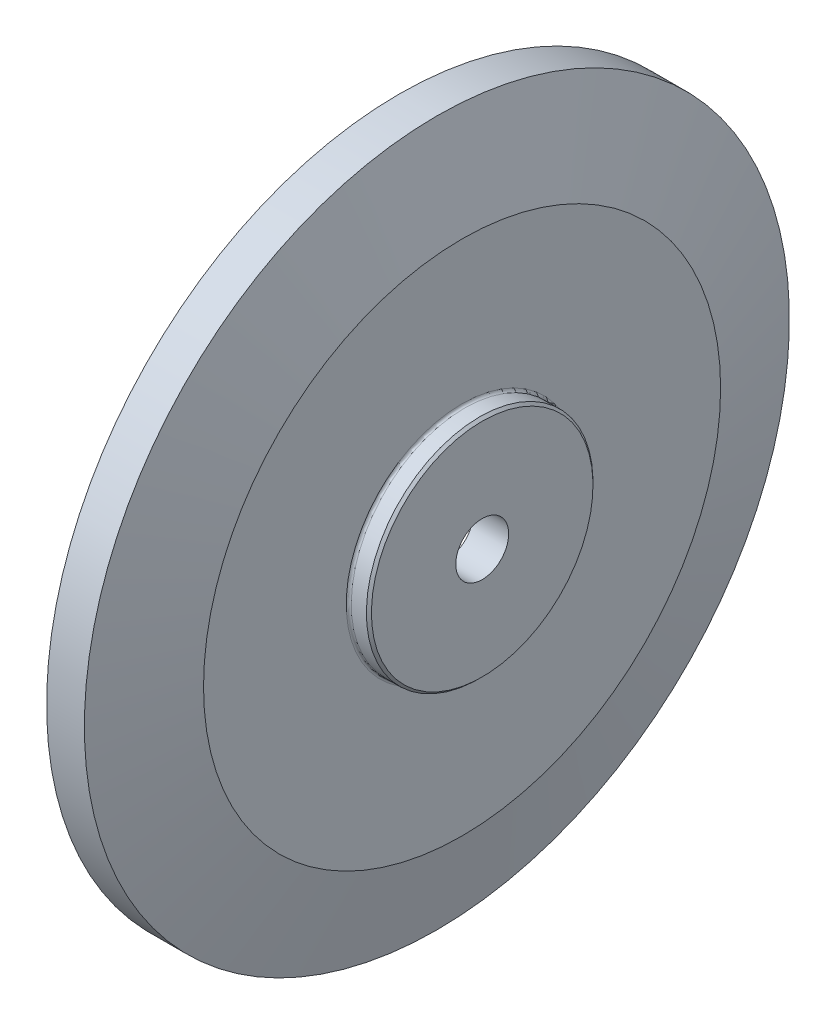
from build123d import *

# Parameters (mm, degrees)
SFAZOWANIE2_SIZE           = 10
SFAZOWANIE2_SIZE2          = 37.320508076
SFAZOWANIE3_SIZE           = 5
ZAOKR_GLENIE1_R            = 1
SFAZOWANIE4_SIZE           = 1
SZKIC2_R                   = 30
WYTNIJ_WYCI_GNI_CIE1_DEPTH = 12
OTW_R_POD_RUB_M201_D       = 21


with BuildPart() as part:
    # Szkic1 → Obr_t1 (revolve)
    with BuildSketch(Plane.XY):
        Polygon((-31.247176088, 140), (-31.247176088, 100), (-24.247176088, 100), (-24.247176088, 0), (1.752823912, 0), (1.752823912, 45), (-6.247176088, 45), (-6.247176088, 140), align=None)
    revolve(axis=Axis((0, 0, 0), (-1, 0, 0)))

    # Sfazowanie2
    sfazowanie2_edges = [part.edges().sort_by_distance(p)[0] for p in [
        (-6.247176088, -140, 0),
    ]]
    sfazowanie2_side = [part.faces().sort_by_distance(p)[0] for p in [
        (-18.747176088, -140, 0),
    ]]
    chamfer(sfazowanie2_edges, length=SFAZOWANIE2_SIZE, length2=SFAZOWANIE2_SIZE2, reference=sfazowanie2_side[0])

    # Sfazowanie3
    sfazowanie3_edges = [part.edges().sort_by_distance(p)[0] for p in [
        (-24.247176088, -100, 0),
    ]]
    chamfer(sfazowanie3_edges, length=SFAZOWANIE3_SIZE)

    # Zaokr_glenie1
    zaokr_glenie1_edges = [part.edges().sort_by_distance(p)[0] for p in [
        (-6.247176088, -45, 0),
    ]]
    fillet(zaokr_glenie1_edges, radius=ZAOKR_GLENIE1_R)

    # Sfazowanie4
    sfazowanie4_edges = [part.edges().sort_by_distance(p)[0] for p in [
        (1.752823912, -45, 0),
    ]]
    chamfer(sfazowanie4_edges, length=SFAZOWANIE4_SIZE)

    # Szkic2 → Wytnij-wyci_gni_cie1 (cut)
    with BuildSketch(Plane.ZY.offset(24.247176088)):
        with Locations(Location((0, 0, 0), (0, 0, 270))):
            Circle(SZKIC2_R)
    extrude(amount=-WYTNIJ_WYCI_GNI_CIE1_DEPTH, mode=Mode.SUBTRACT)

    # Otw_r pod _rub_ M201 (through all)
    with Locations(Plane.ZY.offset(12.247176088)):
        with Locations((0, 0)):
            Hole(OTW_R_POD_RUB_M201_D / 2)


solid = part.part
